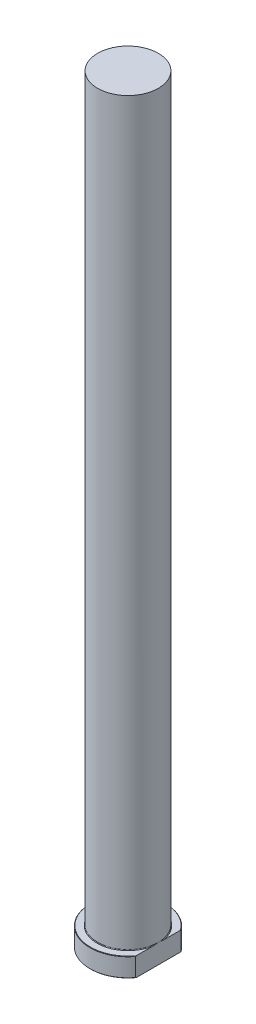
ISO-10303-21;
HEADER;
FILE_DESCRIPTION(('STEP AP214'),'2;1');
FILE_NAME('part.step','',(''),(''),'','','');
FILE_SCHEMA(('AUTOMOTIVE_DESIGN { 1 0 10303 214 1 1 1 1 }'));
ENDSEC;
DATA;
#1=APPLICATION_CONTEXT('core data for automotive mechanical design processes');
#2=APPLICATION_PROTOCOL_DEFINITION('international standard','automotive_design',2000,#1);
#3=PRODUCT_CONTEXT('',#1,'mechanical');
#4=PRODUCT('Part','Part','',(#3));
#5=PRODUCT_RELATED_PRODUCT_CATEGORY('part','',(#4));
#6=PRODUCT_DEFINITION_FORMATION('','',#4);
#7=PRODUCT_DEFINITION_CONTEXT('part definition',#1,'design');
#8=PRODUCT_DEFINITION('design','',#6,#7);
#9=PRODUCT_DEFINITION_SHAPE('','',#8);
#10=(LENGTH_UNIT() NAMED_UNIT(*) SI_UNIT(.MILLI.,.METRE.));
#11=(NAMED_UNIT(*) PLANE_ANGLE_UNIT() SI_UNIT($,.RADIAN.));
#12=(NAMED_UNIT(*) SI_UNIT($,.STERADIAN.) SOLID_ANGLE_UNIT());
#13=UNCERTAINTY_MEASURE_WITH_UNIT(LENGTH_MEASURE(1.E-05),#10,'distance_accuracy_value','');
#14=(GEOMETRIC_REPRESENTATION_CONTEXT(3) GLOBAL_UNCERTAINTY_ASSIGNED_CONTEXT((#13)) GLOBAL_UNIT_ASSIGNED_CONTEXT((#10,
#11,#12)) REPRESENTATION_CONTEXT('',''));
#15=CARTESIAN_POINT('',(0.,0.,0.));
#16=DIRECTION('',(0.,0.,1.));
#17=DIRECTION('',(1.,0.,0.));
#18=AXIS2_PLACEMENT_3D('',#15,#16,#17);
#19=CARTESIAN_POINT('',(0.,0.,0.));
#20=DIRECTION('',(0.,-1.,0.));
#21=DIRECTION('',(0.,0.,-1.));
#22=AXIS2_PLACEMENT_3D('',#19,#20,#21);
#23=PLANE('',#22);
#24=CARTESIAN_POINT('',(0.,0.,0.));
#25=DIRECTION('',(0.,-1.,0.));
#26=DIRECTION('',(0.,0.,-1.));
#27=AXIS2_PLACEMENT_3D('',#24,#25,#26);
#28=CIRCLE('',#27,19.8);
#29=CARTESIAN_POINT('',(16.,0.,11.6636186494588));
#30=VERTEX_POINT('',#29);
#31=CARTESIAN_POINT('',(16.,0.,-11.6636186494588));
#32=VERTEX_POINT('',#31);
#33=EDGE_CURVE('E98',#30,#32,#28,.T.);
#34=ORIENTED_EDGE('',*,*,#33,.T.);
#35=DIRECTION('',(0.,0.,1.));
#36=VECTOR('',#35,1.);
#37=CARTESIAN_POINT('',(16.,0.,-12.));
#38=LINE('',#37,#36);
#39=EDGE_CURVE('E83',#32,#30,#38,.T.);
#40=ORIENTED_EDGE('',*,*,#39,.T.);
#41=EDGE_LOOP('',(#34,#40));
#42=FACE_BOUND('',#41,.T.);
#43=ADVANCED_FACE('F32',(#42),#23,.T.);
#44=CARTESIAN_POINT('',(0.,259.958771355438,0.));
#45=DIRECTION('',(0.,1.,0.));
#46=DIRECTION('',(0.,0.,1.));
#47=AXIS2_PLACEMENT_3D('',#44,#45,#46);
#48=CYLINDRICAL_SURFACE('',#47,20.);
#49=CARTESIAN_POINT('',(0.,9.80000000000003,0.));
#50=DIRECTION('',(0.,1.,0.));
#51=DIRECTION('',(0.,0.,1.));
#52=AXIS2_PLACEMENT_3D('',#49,#50,#51);
#53=CIRCLE('',#52,20.);
#54=CARTESIAN_POINT('',(16.,9.80000000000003,12.));
#55=VERTEX_POINT('',#54);
#56=CARTESIAN_POINT('',(16.,9.80000000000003,-12.));
#57=VERTEX_POINT('',#56);
#58=EDGE_CURVE('E104',#55,#57,#53,.F.);
#59=ORIENTED_EDGE('',*,*,#58,.T.);
#60=DIRECTION('',(0.,-1.,0.));
#61=VECTOR('',#60,1.);
#62=CARTESIAN_POINT('',(16.,400.,-12.));
#63=LINE('',#62,#61);
#64=CARTESIAN_POINT('',(16.,0.199999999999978,-12.));
#65=VERTEX_POINT('',#64);
#66=EDGE_CURVE('E183',#57,#65,#63,.T.);
#67=ORIENTED_EDGE('',*,*,#66,.T.);
#68=CARTESIAN_POINT('',(0.,0.199999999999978,0.));
#69=DIRECTION('',(0.,-1.,0.));
#70=DIRECTION('',(0.,0.,-1.));
#71=AXIS2_PLACEMENT_3D('',#68,#69,#70);
#72=CIRCLE('',#71,20.);
#73=CARTESIAN_POINT('',(16.,0.199999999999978,12.));
#74=VERTEX_POINT('',#73);
#75=EDGE_CURVE('E100',#65,#74,#72,.F.);
#76=ORIENTED_EDGE('',*,*,#75,.T.);
#77=DIRECTION('',(0.,-1.,0.));
#78=VECTOR('',#77,1.);
#79=CARTESIAN_POINT('',(16.,400.,12.));
#80=LINE('',#79,#78);
#81=EDGE_CURVE('E93',#55,#74,#80,.T.);
#82=ORIENTED_EDGE('',*,*,#81,.F.);
#83=EDGE_LOOP('',(#59,#67,#76,#82));
#84=FACE_BOUND('',#83,.T.);
#85=ADVANCED_FACE('F158',(#84),#48,.T.);
#86=CARTESIAN_POINT('',(-20.,10.,0.));
#87=DIRECTION('',(0.,1.,0.));
#88=DIRECTION('',(0.,0.,1.));
#89=AXIS2_PLACEMENT_3D('',#86,#87,#88);
#90=PLANE('',#89);
#91=CARTESIAN_POINT('',(0.,10.,0.));
#92=DIRECTION('',(0.,1.,0.));
#93=DIRECTION('',(0.,0.,1.));
#94=AXIS2_PLACEMENT_3D('',#91,#92,#93);
#95=CIRCLE('',#94,19.8000000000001);
#96=CARTESIAN_POINT('',(16.,10.,-11.6636186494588));
#97=VERTEX_POINT('',#96);
#98=CARTESIAN_POINT('',(16.,10.,11.6636186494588));
#99=VERTEX_POINT('',#98);
#100=EDGE_CURVE('E178',#97,#99,#95,.T.);
#101=ORIENTED_EDGE('',*,*,#100,.T.);
#102=DIRECTION('',(0.,0.,-1.));
#103=VECTOR('',#102,1.);
#104=CARTESIAN_POINT('',(16.,10.,0.));
#105=LINE('',#104,#103);
#106=CARTESIAN_POINT('',(16.,10.,3.1128764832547));
#107=VERTEX_POINT('',#106);
#108=EDGE_CURVE('E57',#99,#107,#105,.T.);
#109=ORIENTED_EDGE('',*,*,#108,.T.);
#110=CARTESIAN_POINT('',(0.,10.,0.));
#111=DIRECTION('',(0.,1.,0.));
#112=DIRECTION('',(0.,0.,1.));
#113=AXIS2_PLACEMENT_3D('',#110,#111,#112);
#114=CIRCLE('',#113,16.3);
#115=CARTESIAN_POINT('',(16.,10.,-3.11287648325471));
#116=VERTEX_POINT('',#115);
#117=EDGE_CURVE('E107',#107,#116,#114,.F.);
#118=ORIENTED_EDGE('',*,*,#117,.T.);
#119=EDGE_CURVE('E136',#116,#97,#105,.T.);
#120=ORIENTED_EDGE('',*,*,#119,.T.);
#121=EDGE_LOOP('',(#101,#109,#118,#120));
#122=FACE_BOUND('',#121,.T.);
#123=ADVANCED_FACE('F147',(#122),#90,.T.);
#124=CARTESIAN_POINT('',(0.,10.,0.));
#125=DIRECTION('',(0.,-1.,0.));
#126=DIRECTION('',(0.,0.,-1.));
#127=AXIS2_PLACEMENT_3D('',#124,#125,#126);
#128=CONICAL_SURFACE('',#127,19.8,0.785398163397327);
#129=ORIENTED_EDGE('',*,*,#58,.F.);
#130=CARTESIAN_POINT('',(16.,-1.07064884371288,26.4006999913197));
#131=CARTESIAN_POINT('',(16.,-0.733156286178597,26.0060486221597));
#132=CARTESIAN_POINT('',(16.,-0.396819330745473,25.6104050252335));
#133=CARTESIAN_POINT('',(16.,0.27320617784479,24.8168690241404));
#134=CARTESIAN_POINT('',(16.,0.606894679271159,24.4189765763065));
#135=CARTESIAN_POINT('',(16.,1.27144329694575,23.6204891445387));
#136=CARTESIAN_POINT('',(16.,1.60230187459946,23.2198928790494));
#137=CARTESIAN_POINT('',(16.,2.26059114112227,22.4158945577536));
#138=CARTESIAN_POINT('',(16.,2.58802184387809,22.0124925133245));
#139=CARTESIAN_POINT('',(16.,3.24766747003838,21.1916872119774));
#140=CARTESIAN_POINT('',(16.,3.57977582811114,20.7741982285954));
#141=CARTESIAN_POINT('',(16.,4.23919239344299,19.935447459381));
#142=CARTESIAN_POINT('',(16.,4.56650063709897,19.5141857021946));
#143=CARTESIAN_POINT('',(16.,5.21544461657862,18.6674666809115));
#144=CARTESIAN_POINT('',(16.,5.53708166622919,18.242010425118));
#145=CARTESIAN_POINT('',(16.,6.17378218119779,17.3861997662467));
#146=CARTESIAN_POINT('',(16.,6.48884565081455,16.9558453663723));
#147=CARTESIAN_POINT('',(16.,7.11176935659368,16.0887218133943));
#148=CARTESIAN_POINT('',(16.,7.41961501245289,15.6519421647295));
#149=CARTESIAN_POINT('',(16.,8.02597466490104,14.7719292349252));
#150=CARTESIAN_POINT('',(16.,8.32448855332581,14.3286958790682));
#151=CARTESIAN_POINT('',(16.,8.91052998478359,13.4344389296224));
#152=CARTESIAN_POINT('',(16.,9.19804754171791,12.9834087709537));
#153=CARTESIAN_POINT('',(16.,9.75938980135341,12.0728858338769));
#154=CARTESIAN_POINT('',(16.,10.0332147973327,11.6133932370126));
#155=CARTESIAN_POINT('',(16.,10.5615335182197,10.6892898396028));
#156=CARTESIAN_POINT('',(16.,10.8161891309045,10.2247720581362));
#157=CARTESIAN_POINT('',(16.,11.3053445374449,9.28510847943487));
#158=CARTESIAN_POINT('',(16.,11.5398419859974,8.80996145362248));
#159=CARTESIAN_POINT('',(16.,11.9836278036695,7.84885100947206));
#160=CARTESIAN_POINT('',(16.,12.1929556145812,7.36290596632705));
#161=CARTESIAN_POINT('',(16.,12.5811435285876,6.37912337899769));
#162=CARTESIAN_POINT('',(16.,12.7600157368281,5.88129064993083));
#163=CARTESIAN_POINT('',(16.,13.0861366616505,4.85753764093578));
#164=CARTESIAN_POINT('',(16.,13.23219103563,4.33122827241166));
#165=CARTESIAN_POINT('',(16.,13.4164504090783,3.53379728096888));
#166=CARTESIAN_POINT('',(16.,13.4720698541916,3.26663533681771));
#167=CARTESIAN_POINT('',(16.,13.5709016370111,2.73003918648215));
#168=CARTESIAN_POINT('',(16.,13.614115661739,2.46060529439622));
#169=CARTESIAN_POINT('',(16.,13.6872774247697,1.9211763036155));
#170=CARTESIAN_POINT('',(16.,13.7172841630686,1.65118922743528));
#171=CARTESIAN_POINT('',(16.,13.7638048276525,1.11005042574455));
#172=CARTESIAN_POINT('',(16.,13.7803188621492,0.838898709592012));
#173=CARTESIAN_POINT('',(16.,13.7995586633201,0.296109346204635));
#174=CARTESIAN_POINT('',(16.,13.80228470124,0.0244717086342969));
#175=CARTESIAN_POINT('',(16.,13.7939006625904,-0.518588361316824));
#176=CARTESIAN_POINT('',(16.,13.7827905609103,-0.790010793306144));
#177=CARTESIAN_POINT('',(16.,13.7469663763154,-1.33142514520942));
#178=CARTESIAN_POINT('',(16.,13.7222788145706,-1.60141882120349));
#179=CARTESIAN_POINT('',(16.,13.6597540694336,-2.13989179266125));
#180=CARTESIAN_POINT('',(16.,13.6219151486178,-2.4083708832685));
#181=CARTESIAN_POINT('',(16.,13.4895557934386,-3.21066813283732));
#182=CARTESIAN_POINT('',(16.,13.3761851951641,-3.74145456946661));
#183=CARTESIAN_POINT('',(16.,13.1048507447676,-4.79469191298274));
#184=CARTESIAN_POINT('',(16.,12.946620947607,-5.31707285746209));
#185=CARTESIAN_POINT('',(16.,12.6815624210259,-6.09095035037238));
#186=CARTESIAN_POINT('',(16.,12.5885858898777,-6.34730496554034));
#187=CARTESIAN_POINT('',(16.,12.3942381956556,-6.85681818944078));
#188=CARTESIAN_POINT('',(16.,12.2928668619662,-7.10997673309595));
#189=CARTESIAN_POINT('',(16.,11.9087737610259,-8.02895093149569));
#190=CARTESIAN_POINT('',(16.,11.6032209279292,-8.68528507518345));
#191=CARTESIAN_POINT('',(16.,10.9520387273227,-9.97785473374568));
#192=CARTESIAN_POINT('',(16.,10.6063845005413,-10.6140774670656));
#193=CARTESIAN_POINT('',(16.,9.88410853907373,-11.8704402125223));
#194=CARTESIAN_POINT('',(16.,9.50742027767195,-12.4905417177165));
#195=CARTESIAN_POINT('',(16.,8.73104614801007,-13.7158784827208));
#196=CARTESIAN_POINT('',(16.,8.33136526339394,-14.3211169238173));
#197=CARTESIAN_POINT('',(16.,7.51225576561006,-15.5221520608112));
#198=CARTESIAN_POINT('',(16.,7.09274396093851,-16.1178917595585));
#199=CARTESIAN_POINT('',(16.,6.23957009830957,-17.2991512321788));
#200=CARTESIAN_POINT('',(16.,5.80590743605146,-17.8846705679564));
#201=CARTESIAN_POINT('',(16.,4.9278350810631,-19.0464967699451));
#202=CARTESIAN_POINT('',(16.,4.48343853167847,-19.6228135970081));
#203=CARTESIAN_POINT('',(16.,3.58557777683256,-20.7683027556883));
#204=CARTESIAN_POINT('',(16.,3.13211380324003,-21.337475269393));
#205=CARTESIAN_POINT('',(16.,2.3674402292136,-22.2844266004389));
#206=CARTESIAN_POINT('',(16.,2.05826684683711,-22.6638539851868));
#207=CARTESIAN_POINT('',(16.,1.43690833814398,-23.420322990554));
#208=CARTESIAN_POINT('',(16.,1.12472279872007,-23.7973642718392));
#209=CARTESIAN_POINT('',(16.,0.49995656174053,-24.5465888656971));
#210=CARTESIAN_POINT('',(16.,0.18739441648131,-24.9187876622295));
#211=CARTESIAN_POINT('',(16.,-0.439990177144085,-25.6611808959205));
#212=CARTESIAN_POINT('',(16.,-0.754812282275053,-26.0313756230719));
#213=CARTESIAN_POINT('',(16.,-1.07064884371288,-26.4006999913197));
#214=B_SPLINE_CURVE_WITH_KNOTS('',3,(#130,#131,#132,#133,#134,#135,#136,#137,#138,#139,#140,
#141,#142,#143,#144,#145,#146,#147,#148,#149,#150,#151,#152,#153,#154,#155,#156,#157,#158,#159,
#160,#161,#162,#163,#164,#165,#166,#167,#168,#169,#170,#171,#172,#173,#174,#175,#176,#177,#178,
#179,#180,#181,#182,#183,#184,#185,#186,#187,#188,#189,#190,#191,#192,#193,#194,#195,#196,#197,
#198,#199,#200,#201,#202,#203,#204,#205,#206,#207,#208,#209,#210,#211,#212,#213),.UNSPECIFIED.,
.F.,.F.,(4,2,2,2,2,2,2,2,2,2,2,2,2,2,2,2,2,2,2,2,2,2,2,2,2,2,2,2,2,2,2,2,2,2,2,2,2,2,2,2,2,4),
(0.,1.55783999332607,3.11571034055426,4.67437978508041,6.23304291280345,7.83343038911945,
9.43380572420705,11.0338053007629,12.6338038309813,14.2367959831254,15.8398067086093,
17.4442401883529,19.0486392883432,20.6374598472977,22.2264650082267,23.8129467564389,
25.3987964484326,27.0353648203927,27.8537926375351,28.6721091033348,29.4867319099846,
30.3013481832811,31.1159484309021,31.9305501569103,32.7435663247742,33.5566899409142,
35.1826128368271,36.8183840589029,37.6363419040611,38.4543163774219,40.6241539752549,
42.795343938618,44.9713157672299,47.1468177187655,49.3324366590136,51.5181490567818,
53.7013086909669,55.8844125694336,57.3527237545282,58.821239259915,60.2793254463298,
61.7371946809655),.UNSPECIFIED.);
#215=EDGE_CURVE('E135',#55,#99,#214,.T.);
#216=ORIENTED_EDGE('',*,*,#215,.T.);
#217=ORIENTED_EDGE('',*,*,#100,.F.);
#218=EDGE_CURVE('E127',#97,#57,#214,.T.);
#219=ORIENTED_EDGE('',*,*,#218,.T.);
#220=EDGE_LOOP('',(#129,#216,#217,#219));
#221=FACE_BOUND('',#220,.T.);
#222=ADVANCED_FACE('F143',(#221),#128,.T.);
#223=CARTESIAN_POINT('',(0.,0.199999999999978,0.));
#224=DIRECTION('',(0.,1.,0.));
#225=DIRECTION('',(0.,0.,1.));
#226=AXIS2_PLACEMENT_3D('',#223,#224,#225);
#227=CONICAL_SURFACE('',#226,20.,0.785398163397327);
#228=ORIENTED_EDGE('',*,*,#75,.F.);
#229=CARTESIAN_POINT('',(16.,11.0706488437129,-26.4006999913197));
#230=CARTESIAN_POINT('',(16.,10.7331562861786,-26.0060486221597));
#231=CARTESIAN_POINT('',(16.,10.3968193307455,-25.6104050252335));
#232=CARTESIAN_POINT('',(16.,9.72679382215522,-24.8168690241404));
#233=CARTESIAN_POINT('',(16.,9.39310532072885,-24.4189765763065));
#234=CARTESIAN_POINT('',(16.,8.72855670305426,-23.6204891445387));
#235=CARTESIAN_POINT('',(16.,8.39769812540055,-23.2198928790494));
#236=CARTESIAN_POINT('',(16.,7.73940885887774,-22.4158945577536));
#237=CARTESIAN_POINT('',(16.,7.41197815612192,-22.0124925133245));
#238=CARTESIAN_POINT('',(16.,6.75233252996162,-21.1916872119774));
#239=CARTESIAN_POINT('',(16.,6.42022417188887,-20.7741982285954));
#240=CARTESIAN_POINT('',(16.,5.76080760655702,-19.935447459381));
#241=CARTESIAN_POINT('',(16.,5.43349936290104,-19.5141857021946));
#242=CARTESIAN_POINT('',(16.,4.78455538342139,-18.6674666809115));
#243=CARTESIAN_POINT('',(16.,4.46291833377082,-18.242010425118));
#244=CARTESIAN_POINT('',(16.,3.82621781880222,-17.3861997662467));
#245=CARTESIAN_POINT('',(16.,3.51115434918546,-16.9558453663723));
#246=CARTESIAN_POINT('',(16.,2.88823064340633,-16.0887218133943));
#247=CARTESIAN_POINT('',(16.,2.58038498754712,-15.6519421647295));
#248=CARTESIAN_POINT('',(16.,1.97402533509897,-14.7719292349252));
#249=CARTESIAN_POINT('',(16.,1.6755114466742,-14.3286958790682));
#250=CARTESIAN_POINT('',(16.,1.08947001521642,-13.4344389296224));
#251=CARTESIAN_POINT('',(16.,0.801952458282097,-12.9834087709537));
#252=CARTESIAN_POINT('',(16.,0.240610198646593,-12.0728858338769));
#253=CARTESIAN_POINT('',(16.,-0.0332147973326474,-11.6133932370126));
#254=CARTESIAN_POINT('',(16.,-0.561533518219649,-10.6892898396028));
#255=CARTESIAN_POINT('',(16.,-0.816189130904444,-10.2247720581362));
#256=CARTESIAN_POINT('',(16.,-1.30534453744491,-9.28510847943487));
#257=CARTESIAN_POINT('',(16.,-1.53984198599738,-8.80996145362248));
#258=CARTESIAN_POINT('',(16.,-1.98362780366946,-7.84885100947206));
#259=CARTESIAN_POINT('',(16.,-2.19295561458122,-7.36290596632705));
#260=CARTESIAN_POINT('',(16.,-2.58114352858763,-6.3791233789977));
#261=CARTESIAN_POINT('',(16.,-2.76001573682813,-5.88129064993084));
#262=CARTESIAN_POINT('',(16.,-3.08613666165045,-4.85753764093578));
#263=CARTESIAN_POINT('',(16.,-3.23219103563,-4.33122827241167));
#264=CARTESIAN_POINT('',(16.,-3.41645040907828,-3.53379728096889));
#265=CARTESIAN_POINT('',(16.,-3.47206985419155,-3.26663533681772));
#266=CARTESIAN_POINT('',(16.,-3.57090163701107,-2.73003918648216));
#267=CARTESIAN_POINT('',(16.,-3.61411566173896,-2.46060529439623));
#268=CARTESIAN_POINT('',(16.,-3.68727742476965,-1.9211763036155));
#269=CARTESIAN_POINT('',(16.,-3.71728416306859,-1.65118922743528));
#270=CARTESIAN_POINT('',(16.,-3.7638048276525,-1.11005042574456));
#271=CARTESIAN_POINT('',(16.,-3.78031886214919,-0.838898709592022));
#272=CARTESIAN_POINT('',(16.,-3.79955866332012,-0.296109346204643));
#273=CARTESIAN_POINT('',(16.,-3.80228470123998,-0.0244717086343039));
#274=CARTESIAN_POINT('',(16.,-3.79390066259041,0.518588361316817));
#275=CARTESIAN_POINT('',(16.,-3.78279056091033,0.790010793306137));
#276=CARTESIAN_POINT('',(16.,-3.74696637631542,1.33142514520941));
#277=CARTESIAN_POINT('',(16.,-3.72227881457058,1.60141882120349));
#278=CARTESIAN_POINT('',(16.,-3.65975406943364,2.13989179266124));
#279=CARTESIAN_POINT('',(16.,-3.62191514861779,2.40837088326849));
#280=CARTESIAN_POINT('',(16.,-3.48955579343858,3.21066813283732));
#281=CARTESIAN_POINT('',(16.,-3.37618519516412,3.7414545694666));
#282=CARTESIAN_POINT('',(16.,-3.10485074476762,4.79469191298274));
#283=CARTESIAN_POINT('',(16.,-2.94662094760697,5.31707285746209));
#284=CARTESIAN_POINT('',(16.,-2.68156242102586,6.09095035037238));
#285=CARTESIAN_POINT('',(16.,-2.58858588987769,6.34730496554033));
#286=CARTESIAN_POINT('',(16.,-2.39423819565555,6.85681818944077));
#287=CARTESIAN_POINT('',(16.,-2.29286686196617,7.10997673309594));
#288=CARTESIAN_POINT('',(16.,-1.90877376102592,8.02895093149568));
#289=CARTESIAN_POINT('',(16.,-1.60322092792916,8.68528507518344));
#290=CARTESIAN_POINT('',(16.,-0.952038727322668,9.97785473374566));
#291=CARTESIAN_POINT('',(16.,-0.606384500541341,10.6140774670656));
#292=CARTESIAN_POINT('',(16.,0.115891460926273,11.8704402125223));
#293=CARTESIAN_POINT('',(16.,0.492579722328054,12.4905417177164));
#294=CARTESIAN_POINT('',(16.,1.26895385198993,13.7158784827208));
#295=CARTESIAN_POINT('',(16.,1.66863473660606,14.3211169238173));
#296=CARTESIAN_POINT('',(16.,2.48774423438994,15.5221520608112));
#297=CARTESIAN_POINT('',(16.,2.90725603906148,16.1178917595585));
#298=CARTESIAN_POINT('',(16.,3.76042990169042,17.2991512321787));
#299=CARTESIAN_POINT('',(16.,4.19409256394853,17.8846705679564));
#300=CARTESIAN_POINT('',(16.,5.07216491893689,19.0464967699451));
#301=CARTESIAN_POINT('',(16.,5.51656146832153,19.622813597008));
#302=CARTESIAN_POINT('',(16.,6.41442222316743,20.7683027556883));
#303=CARTESIAN_POINT('',(16.,6.86788619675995,21.337475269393));
#304=CARTESIAN_POINT('',(16.,7.63255977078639,22.2844266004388));
#305=CARTESIAN_POINT('',(16.,7.94173315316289,22.6638539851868));
#306=CARTESIAN_POINT('',(16.,8.56309166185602,23.4203229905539));
#307=CARTESIAN_POINT('',(16.,8.87527720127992,23.7973642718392));
#308=CARTESIAN_POINT('',(16.,9.50004343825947,24.5465888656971));
#309=CARTESIAN_POINT('',(16.,9.81260558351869,24.9187876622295));
#310=CARTESIAN_POINT('',(16.,10.4399901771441,25.6611808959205));
#311=CARTESIAN_POINT('',(16.,10.7548122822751,26.0313756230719));
#312=CARTESIAN_POINT('',(16.,11.0706488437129,26.4006999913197));
#313=B_SPLINE_CURVE_WITH_KNOTS('',3,(#229,#230,#231,#232,#233,#234,#235,#236,#237,#238,#239,
#240,#241,#242,#243,#244,#245,#246,#247,#248,#249,#250,#251,#252,#253,#254,#255,#256,#257,#258,
#259,#260,#261,#262,#263,#264,#265,#266,#267,#268,#269,#270,#271,#272,#273,#274,#275,#276,#277,
#278,#279,#280,#281,#282,#283,#284,#285,#286,#287,#288,#289,#290,#291,#292,#293,#294,#295,#296,
#297,#298,#299,#300,#301,#302,#303,#304,#305,#306,#307,#308,#309,#310,#311,#312),.UNSPECIFIED.,
.F.,.F.,(4,2,2,2,2,2,2,2,2,2,2,2,2,2,2,2,2,2,2,2,2,2,2,2,2,2,2,2,2,2,2,2,2,2,2,2,2,2,2,2,2,4),
(0.,1.55783999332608,3.11571034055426,4.67437978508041,6.23304291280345,7.83343038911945,
9.43380572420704,11.0338053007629,12.6338038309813,14.2367959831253,15.8398067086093,
17.4442401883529,19.0486392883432,20.6374598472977,22.2264650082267,23.8129467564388,
25.3987964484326,27.0353648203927,27.8537926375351,28.6721091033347,29.4867319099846,
30.3013481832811,31.1159484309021,31.9305501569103,32.7435663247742,33.5566899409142,
35.1826128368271,36.8183840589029,37.6363419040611,38.4543163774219,40.6241539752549,
42.795343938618,44.9713157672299,47.1468177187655,49.3324366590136,51.5181490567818,
53.7013086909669,55.8844125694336,57.3527237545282,58.821239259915,60.2793254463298,
61.7371946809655),.UNSPECIFIED.);
#314=EDGE_CURVE('E86',#65,#32,#313,.T.);
#315=ORIENTED_EDGE('',*,*,#314,.T.);
#316=ORIENTED_EDGE('',*,*,#33,.F.);
#317=EDGE_CURVE('E89',#30,#74,#313,.T.);
#318=ORIENTED_EDGE('',*,*,#317,.T.);
#319=EDGE_LOOP('',(#228,#315,#316,#318));
#320=FACE_BOUND('',#319,.T.);
#321=ADVANCED_FACE('F97',(#320),#227,.T.);
#322=CARTESIAN_POINT('',(0.,10.3,0.));
#323=DIRECTION('',(0.,1.,0.));
#324=DIRECTION('',(0.,0.,1.));
#325=AXIS2_PLACEMENT_3D('',#322,#323,#324);
#326=TOROIDAL_SURFACE('',#325,16.3,0.3);
#327=CARTESIAN_POINT('',(16.,10.3,0.));
#328=CARTESIAN_POINT('',(16.,10.3000006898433,-5.33715911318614E-09));
#329=CARTESIAN_POINT('',(16.,10.3000013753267,-5.90477996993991E-07));
#330=CARTESIAN_POINT('',(16.,10.3000026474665,-1.99315110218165E-06));
#331=CARTESIAN_POINT('',(16.,10.3000031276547,-2.82387138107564E-06));
#332=CARTESIAN_POINT('',(16.,10.300004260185,-4.93201352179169E-06));
#333=CARTESIAN_POINT('',(16.,10.300004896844,-6.24688723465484E-06));
#334=CARTESIAN_POINT('',(16.,10.3000059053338,-8.79561581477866E-06));
#335=CARTESIAN_POINT('',(16.,10.3000062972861,-1.00244169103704E-05));
#336=CARTESIAN_POINT('',(16.,10.3000079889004,-1.53269558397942E-05));
#337=CARTESIAN_POINT('',(16.,10.3000092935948,-1.94146126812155E-05));
#338=CARTESIAN_POINT('',(16.,10.3000111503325,-2.70530674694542E-05));
#339=CARTESIAN_POINT('',(16.,10.300011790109,-3.05834546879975E-05));
#340=CARTESIAN_POINT('',(16.,10.3000164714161,-5.69924666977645E-05));
#341=CARTESIAN_POINT('',(16.,10.3000199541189,-7.99464318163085E-05));
#342=CARTESIAN_POINT('',(16.,10.3000322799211,-0.000171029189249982));
#343=CARTESIAN_POINT('',(16.,10.3000382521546,-0.000239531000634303));
#344=CARTESIAN_POINT('',(16.,10.3000656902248,-0.00050618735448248));
#345=CARTESIAN_POINT('',(16.,10.3000950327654,-0.0007033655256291));
#346=CARTESIAN_POINT('',(16.,10.3002038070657,-0.0014556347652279));
#347=CARTESIAN_POINT('',(16.,10.300277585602,-0.00201139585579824));
#348=CARTESIAN_POINT('',(16.,10.3005644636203,-0.00414914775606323));
#349=CARTESIAN_POINT('',(16.,10.300783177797,-0.00573048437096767));
#350=CARTESIAN_POINT('',(16.,10.3018172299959,-0.0132287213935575));
#351=CARTESIAN_POINT('',(16.,10.3026243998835,-0.0191465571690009));
#352=CARTESIAN_POINT('',(16.,10.3110865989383,-0.0811528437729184));
#353=CARTESIAN_POINT('',(16.,10.3187815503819,-0.137236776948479));
#354=CARTESIAN_POINT('',(16.,10.3348868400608,-0.255096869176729));
#355=CARTESIAN_POINT('',(16.,10.343290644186,-0.316873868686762));
#356=CARTESIAN_POINT('',(16.,10.3571569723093,-0.419331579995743));
#357=CARTESIAN_POINT('',(16.,10.3626434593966,-0.460008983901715));
#358=CARTESIAN_POINT('',(16.,10.3734224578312,-0.540334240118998));
#359=CARTESIAN_POINT('',(16.,10.3787163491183,-0.579981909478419));
#360=CARTESIAN_POINT('',(16.,10.4083966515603,-0.803619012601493));
#361=CARTESIAN_POINT('',(16.,10.4321379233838,-0.987696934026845));
#362=CARTESIAN_POINT('',(16.,10.4771585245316,-1.35808125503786));
#363=CARTESIAN_POINT('',(16.,10.4984099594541,-1.54439106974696));
#364=CARTESIAN_POINT('',(16.,10.5392977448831,-1.94430528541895));
#365=CARTESIAN_POINT('',(16.,10.5582626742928,-2.15798298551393));
#366=CARTESIAN_POINT('',(16.,10.5798230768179,-2.47853128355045));
#367=CARTESIAN_POINT('',(16.,10.5858566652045,-2.58516682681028));
#368=CARTESIAN_POINT('',(16.,10.5950189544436,-2.79855398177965));
#369=CARTESIAN_POINT('',(16.,10.5981480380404,-2.90530557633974));
#370=CARTESIAN_POINT('',(16.,10.6006064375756,-3.11480969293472));
#371=CARTESIAN_POINT('',(16.,10.600075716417,-3.21755992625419));
#372=CARTESIAN_POINT('',(16.,10.5957602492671,-3.37181907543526));
#373=CARTESIAN_POINT('',(16.,10.593726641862,-3.42337702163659));
#374=CARTESIAN_POINT('',(16.,10.5882429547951,-3.52640582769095));
#375=CARTESIAN_POINT('',(16.,10.584793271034,-3.57787670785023));
#376=CARTESIAN_POINT('',(16.,10.5763123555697,-3.67890194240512));
#377=CARTESIAN_POINT('',(16.,10.5713398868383,-3.72846106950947));
#378=CARTESIAN_POINT('',(16.,10.5593485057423,-3.82738811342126));
#379=CARTESIAN_POINT('',(16.,10.5523274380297,-3.87675577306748));
#380=CARTESIAN_POINT('',(16.,10.5356271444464,-3.97473922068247));
#381=CARTESIAN_POINT('',(16.,10.5259654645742,-4.02335780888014));
#382=CARTESIAN_POINT('',(16.,10.5085240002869,-4.09553189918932));
#383=CARTESIAN_POINT('',(16.,10.5022253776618,-4.11944402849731));
#384=CARTESIAN_POINT('',(16.,10.4883597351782,-4.16689390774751));
#385=CARTESIAN_POINT('',(16.,10.4807934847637,-4.19043187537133));
#386=CARTESIAN_POINT('',(16.,10.468072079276,-4.22548932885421));
#387=CARTESIAN_POINT('',(16.,10.463554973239,-4.23724015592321));
#388=CARTESIAN_POINT('',(16.,10.4539723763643,-4.2605292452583));
#389=CARTESIAN_POINT('',(16.,10.4489064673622,-4.27206733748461));
#390=CARTESIAN_POINT('',(16.,10.4380905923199,-4.29485009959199));
#391=CARTESIAN_POINT('',(16.,10.4323392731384,-4.30609413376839));
#392=CARTESIAN_POINT('',(16.,10.4199753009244,-4.32809262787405));
#393=CARTESIAN_POINT('',(16.,10.4133636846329,-4.33884765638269));
#394=CARTESIAN_POINT('',(16.,10.3989169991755,-4.35969720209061));
#395=CARTESIAN_POINT('',(16.,10.3910687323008,-4.36978269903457));
#396=CARTESIAN_POINT('',(16.,10.3737930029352,-4.38847604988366));
#397=CARTESIAN_POINT('',(16.,10.3643793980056,-4.39709563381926));
#398=CARTESIAN_POINT('',(16.,10.349684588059,-4.40721260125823));
#399=CARTESIAN_POINT('',(16.,10.3452411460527,-4.40991204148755));
#400=CARTESIAN_POINT('',(16.,10.3360120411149,-4.41465735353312));
#401=CARTESIAN_POINT('',(16.,10.331226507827,-4.41670347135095));
#402=CARTESIAN_POINT('',(16.,10.321316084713,-4.41997867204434));
#403=CARTESIAN_POINT('',(16.,10.3161880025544,-4.42119837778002));
#404=CARTESIAN_POINT('',(16.,10.3057936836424,-4.42262740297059));
#405=CARTESIAN_POINT('',(16.,10.3005276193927,-4.42283792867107));
#406=CARTESIAN_POINT('',(16.,10.2906214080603,-4.42225569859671));
#407=CARTESIAN_POINT('',(16.,10.285974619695,-4.42156796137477));
#408=CARTESIAN_POINT('',(16.,10.2768560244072,-4.41944337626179));
#409=CARTESIAN_POINT('',(16.,10.2723843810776,-4.41800584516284));
#410=CARTESIAN_POINT('',(16.,10.2619701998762,-4.41381248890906));
#411=CARTESIAN_POINT('',(16.,10.2561483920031,-4.4107598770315));
#412=CARTESIAN_POINT('',(16.,10.2450526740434,-4.40378684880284));
#413=CARTESIAN_POINT('',(16.,10.239780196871,-4.39986424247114));
#414=CARTESIAN_POINT('',(16.,10.2257729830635,-4.38808908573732));
#415=CARTESIAN_POINT('',(16.,10.2175965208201,-4.37958133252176));
#416=CARTESIAN_POINT('',(16.,10.2024790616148,-4.36154434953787));
#417=CARTESIAN_POINT('',(16.,10.1955419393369,-4.35201206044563));
#418=CARTESIAN_POINT('',(16.,10.1791886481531,-4.32717029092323));
#419=CARTESIAN_POINT('',(16.,10.1703884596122,-4.31145991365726));
#420=CARTESIAN_POINT('',(16.,10.154248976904,-4.2792945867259));
#421=CARTESIAN_POINT('',(16.,10.1469131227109,-4.26283799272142));
#422=CARTESIAN_POINT('',(16.,10.1332947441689,-4.22939871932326));
#423=CARTESIAN_POINT('',(16.,10.1270179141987,-4.2124137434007));
#424=CARTESIAN_POINT('',(16.,10.1153239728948,-4.17817736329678));
#425=CARTESIAN_POINT('',(16.,10.1099058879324,-4.16092628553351));
#426=CARTESIAN_POINT('',(16.,10.0949674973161,-4.10989946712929));
#427=CARTESIAN_POINT('',(16.,10.0863847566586,-4.07584989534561));
#428=CARTESIAN_POINT('',(16.,10.0710343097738,-4.00733871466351));
#429=CARTESIAN_POINT('',(16.,10.0642677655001,-3.97287685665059));
#430=CARTESIAN_POINT('',(16.,10.0460186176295,-3.86898411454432));
#431=CARTESIAN_POINT('',(16.,10.036623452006,-3.79918851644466));
#432=CARTESIAN_POINT('',(16.,10.0215249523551,-3.65915321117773));
#433=CARTESIAN_POINT('',(16.,10.0158261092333,-3.58891306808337));
#434=CARTESIAN_POINT('',(16.,10.0072116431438,-3.44836432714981));
#435=CARTESIAN_POINT('',(16.,10.00429218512,-3.37805595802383));
#436=CARTESIAN_POINT('',(16.,10.000668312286,-3.23904020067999));
#437=CARTESIAN_POINT('',(16.,9.99991350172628,-3.17033397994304));
#438=CARTESIAN_POINT('',(16.,10.0001018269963,-3.03292208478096));
#439=CARTESIAN_POINT('',(16.,10.0010450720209,-2.96421641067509));
#440=CARTESIAN_POINT('',(16.,10.0059904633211,-2.75810886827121));
#441=CARTESIAN_POINT('',(16.,10.0121089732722,-2.62075798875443));
#442=CARTESIAN_POINT('',(16.,10.0284391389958,-2.34612718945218));
#443=CARTESIAN_POINT('',(16.,10.0386564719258,-2.20884763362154));
#444=CARTESIAN_POINT('',(16.,10.0621466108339,-1.93454208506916));
#445=CARTESIAN_POINT('',(16.,10.075419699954,-1.79751611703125));
#446=CARTESIAN_POINT('',(16.,10.118522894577,-1.38740066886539));
#447=CARTESIAN_POINT('',(16.,10.1516806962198,-1.11466812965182));
#448=CARTESIAN_POINT('',(16.,10.2220528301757,-0.569702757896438));
#449=CARTESIAN_POINT('',(16.,10.259267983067,-0.297470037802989));
#450=CARTESIAN_POINT('',(16.,10.2965515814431,-0.0251841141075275));
#451=CARTESIAN_POINT('',(16.,10.2965597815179,-0.0251242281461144));
#452=CARTESIAN_POINT('',(16.,10.2972621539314,-0.019994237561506));
#453=CARTESIAN_POINT('',(16.,10.2979507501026,-0.0149234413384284));
#454=CARTESIAN_POINT('',(16.,10.2989595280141,-0.00761717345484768));
#455=CARTESIAN_POINT('',(16.,10.2992705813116,-0.00538056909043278));
#456=CARTESIAN_POINT('',(16.,10.2996656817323,-0.00242425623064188));
#457=CARTESIAN_POINT('',(16.,10.2997604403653,-0.00170587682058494));
#458=CARTESIAN_POINT('',(16.,10.2998960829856,-0.000765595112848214));
#459=CARTESIAN_POINT('',(16.,10.2999290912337,-0.000542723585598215));
#460=CARTESIAN_POINT('',(16.,10.2999593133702,-0.000246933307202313));
#461=CARTESIAN_POINT('',(16.,10.2999656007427,-0.000175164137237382));
#462=CARTESIAN_POINT('',(16.,10.2999790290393,-8.05668880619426E-05));
#463=CARTESIAN_POINT('',(16.,10.2999827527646,-5.72823548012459E-05));
#464=CARTESIAN_POINT('',(16.,10.2999877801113,-3.05492734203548E-05));
#465=CARTESIAN_POINT('',(16.,10.2999884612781,-2.70084595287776E-05));
#466=CARTESIAN_POINT('',(16.,10.2999904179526,-1.93523012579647E-05));
#467=CARTESIAN_POINT('',(16.,10.2999917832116,-1.52589672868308E-05));
#468=CARTESIAN_POINT('',(16.,10.2999935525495,-9.95362422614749E-06));
#469=CARTESIAN_POINT('',(16.,10.2999939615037,-8.72734435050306E-06));
#470=CARTESIAN_POINT('',(16.,10.2999950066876,-6.18658496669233E-06));
#471=CARTESIAN_POINT('',(16.,10.2999956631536,-4.87748836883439E-06));
#472=CARTESIAN_POINT('',(16.,10.2999968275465,-2.7813010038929E-06));
#473=CARTESIAN_POINT('',(16.,10.2999973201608,-1.95628425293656E-06));
#474=CARTESIAN_POINT('',(16.,10.2999986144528,-5.7037197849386E-07));
#475=CARTESIAN_POINT('',(16.,10.299999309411,5.3429283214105E-09));
#476=CARTESIAN_POINT('',(16.,10.3,0.));
#477=B_SPLINE_CURVE_WITH_KNOTS('',3,(#327,#328,#329,#330,#331,#332,#333,#334,#335,#336,#337,
#338,#339,#340,#341,#342,#343,#344,#345,#346,#347,#348,#349,#350,#351,#352,#353,#354,#355,#356,
#357,#358,#359,#360,#361,#362,#363,#364,#365,#366,#367,#368,#369,#370,#371,#372,#373,#374,#375,
#376,#377,#378,#379,#380,#381,#382,#383,#384,#385,#386,#387,#388,#389,#390,#391,#392,#393,#394,
#395,#396,#397,#398,#399,#400,#401,#402,#403,#404,#405,#406,#407,#408,#409,#410,#411,#412,#413,
#414,#415,#416,#417,#418,#419,#420,#421,#422,#423,#424,#425,#426,#427,#428,#429,#430,#431,#432,
#433,#434,#435,#436,#437,#438,#439,#440,#441,#442,#443,#444,#445,#446,#447,#448,#449,#450,#451,
#452,#453,#454,#455,#456,#457,#458,#459,#460,#461,#462,#463,#464,#465,#466,#467,#468,#469,#470,
#471,#472,#473,#474,#475,#476),.UNSPECIFIED.,.T.,.F.,(4,2,2,2,2,2,2,2,2,2,2,2,2,2,2,2,2,2,2,2,2,
2,2,2,2,2,2,2,2,2,2,2,2,2,2,2,2,2,2,2,2,2,2,2,2,2,2,2,2,2,2,2,2,2,2,2,2,2,2,2,2,2,2,2,2,2,2,2,2,
2,2,2,2,2,4),(0.,2.26177734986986E-06,5.26667807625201E-06,9.57510831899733E-06,
1.34525317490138E-05,2.62880070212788E-05,3.70424186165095E-05,0.00010669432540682,
0.000312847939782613,0.00091073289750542,0.00259276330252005,0.00738178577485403,
0.0252998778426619,0.195126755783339,0.382165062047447,0.505302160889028,0.625300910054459,
1.18209491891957,1.74462724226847,2.38803172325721,2.7084197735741,3.02876559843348,
3.33693017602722,3.49170918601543,3.64644495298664,3.79583437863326,3.94538154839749,
4.09395822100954,4.16811893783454,4.24223480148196,4.27999202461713,4.31777822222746,
4.35564029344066,4.39345715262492,4.43170898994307,4.4696386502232,4.485195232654,
4.50074595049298,4.51647028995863,4.53217582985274,4.54619960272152,4.56023617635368,
4.5798446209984,4.59950299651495,4.63470321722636,4.67001163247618,4.72389684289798,
4.77790718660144,4.83219927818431,4.88642936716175,4.99169124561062,5.09702030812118,
5.30811846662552,5.51947262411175,5.73053472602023,5.93664148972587,6.14276150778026,
6.55512598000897,6.96806358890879,7.38103947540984,8.20517107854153,9.0294696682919,
9.02965100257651,9.04500321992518,9.05177741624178,9.05395133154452,9.05462709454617,
9.05484306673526,9.05491380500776,9.05492461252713,9.05493751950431,9.05494140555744,
9.05494572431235,9.05494873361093,9.05495099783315),.UNSPECIFIED.);
#478=CARTESIAN_POINT('',(16.,10.3,0.));
#479=VERTEX_POINT('',#478);
#480=EDGE_CURVE('E11',#116,#479,#477,.T.);
#481=ORIENTED_EDGE('',*,*,#480,.F.);
#482=ORIENTED_EDGE('',*,*,#117,.F.);
#483=CARTESIAN_POINT('',(16.,10.3,0.));
#484=CARTESIAN_POINT('',(16.,10.2999993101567,5.33715953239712E-09));
#485=CARTESIAN_POINT('',(16.,10.2999986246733,5.90477997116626E-07));
#486=CARTESIAN_POINT('',(16.,10.2999973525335,1.99315110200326E-06));
#487=CARTESIAN_POINT('',(16.,10.2999968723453,2.82387138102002E-06));
#488=CARTESIAN_POINT('',(16.,10.299995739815,4.93201352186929E-06));
#489=CARTESIAN_POINT('',(16.,10.299995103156,6.24688723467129E-06));
#490=CARTESIAN_POINT('',(16.,10.2999940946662,8.7956158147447E-06));
#491=CARTESIAN_POINT('',(16.,10.2999937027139,1.00244169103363E-05));
#492=CARTESIAN_POINT('',(16.,10.2999920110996,1.53269558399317E-05));
#493=CARTESIAN_POINT('',(16.,10.2999907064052,1.94146126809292E-05));
#494=CARTESIAN_POINT('',(16.,10.2999888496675,2.70530674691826E-05));
#495=CARTESIAN_POINT('',(16.,10.299988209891,3.05834546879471E-05));
#496=CARTESIAN_POINT('',(16.,10.2999835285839,5.69924666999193E-05));
#497=CARTESIAN_POINT('',(16.,10.2999800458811,7.99464318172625E-05));
#498=CARTESIAN_POINT('',(15.9999999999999,10.2999677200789,0.000171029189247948));
#499=CARTESIAN_POINT('',(16.,10.2999617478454,0.000239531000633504));
#500=CARTESIAN_POINT('',(16.,10.2999343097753,0.000506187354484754));
#501=CARTESIAN_POINT('',(16.,10.2999049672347,0.000703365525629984));
#502=CARTESIAN_POINT('',(15.9999999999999,10.2997961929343,0.00145563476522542));
#503=CARTESIAN_POINT('',(16.,10.299722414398,0.00201139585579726));
#504=CARTESIAN_POINT('',(16.,10.2994355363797,0.004149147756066));
#505=CARTESIAN_POINT('',(16.,10.299216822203,0.00573048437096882));
#506=CARTESIAN_POINT('',(15.9999999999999,10.2981827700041,0.0132287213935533));
#507=CARTESIAN_POINT('',(15.9999999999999,10.2973756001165,0.0191465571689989));
#508=CARTESIAN_POINT('',(16.0000000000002,10.2889134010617,0.0811528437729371));
#509=CARTESIAN_POINT('',(16.,10.2812184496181,0.137236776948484));
#510=CARTESIAN_POINT('',(15.9999999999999,10.2651131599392,0.255096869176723));
#511=CARTESIAN_POINT('',(16.,10.256709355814,0.316873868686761));
#512=CARTESIAN_POINT('',(16.,10.2428430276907,0.419331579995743));
#513=CARTESIAN_POINT('',(16.,10.2373565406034,0.460008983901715));
#514=CARTESIAN_POINT('',(16.,10.2265775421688,0.540334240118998));
#515=CARTESIAN_POINT('',(16.,10.2212836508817,0.579981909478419));
#516=CARTESIAN_POINT('',(16.,10.1916033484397,0.803619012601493));
#517=CARTESIAN_POINT('',(16.,10.1678620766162,0.987696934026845));
#518=CARTESIAN_POINT('',(16.,10.1228414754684,1.35808125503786));
#519=CARTESIAN_POINT('',(16.,10.101590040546,1.54439106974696));
#520=CARTESIAN_POINT('',(16.,10.0607022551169,1.94430528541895));
#521=CARTESIAN_POINT('',(16.,10.0417373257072,2.15798298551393));
#522=CARTESIAN_POINT('',(16.,10.0201769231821,2.47853128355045));
#523=CARTESIAN_POINT('',(16.,10.0141433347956,2.58516682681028));
#524=CARTESIAN_POINT('',(16.,10.0049810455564,2.79855398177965));
#525=CARTESIAN_POINT('',(16.,10.0018519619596,2.90530557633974));
#526=CARTESIAN_POINT('',(16.,9.9993935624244,3.11480969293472));
#527=CARTESIAN_POINT('',(16.,9.99992428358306,3.21755992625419));
#528=CARTESIAN_POINT('',(16.,10.0042397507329,3.37181907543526));
#529=CARTESIAN_POINT('',(16.,10.006273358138,3.42337702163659));
#530=CARTESIAN_POINT('',(16.,10.0117570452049,3.52640582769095));
#531=CARTESIAN_POINT('',(16.,10.015206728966,3.57787670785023));
#532=CARTESIAN_POINT('',(16.,10.0236876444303,3.67890194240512));
#533=CARTESIAN_POINT('',(16.,10.0286601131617,3.72846106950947));
#534=CARTESIAN_POINT('',(16.,10.0406514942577,3.82738811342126));
#535=CARTESIAN_POINT('',(16.,10.0476725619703,3.87675577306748));
#536=CARTESIAN_POINT('',(16.,10.0643728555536,3.97473922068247));
#537=CARTESIAN_POINT('',(16.,10.0740345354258,4.02335780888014));
#538=CARTESIAN_POINT('',(16.,10.0914759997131,4.09553189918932));
#539=CARTESIAN_POINT('',(16.,10.0977746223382,4.11944402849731));
#540=CARTESIAN_POINT('',(16.,10.1116402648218,4.16689390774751));
#541=CARTESIAN_POINT('',(16.,10.1192065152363,4.19043187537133));
#542=CARTESIAN_POINT('',(16.,10.1319279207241,4.22548932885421));
#543=CARTESIAN_POINT('',(16.,10.136445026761,4.23724015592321));
#544=CARTESIAN_POINT('',(16.,10.1460276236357,4.2605292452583));
#545=CARTESIAN_POINT('',(16.,10.1510935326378,4.27206733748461));
#546=CARTESIAN_POINT('',(16.,10.1619094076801,4.29485009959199));
#547=CARTESIAN_POINT('',(16.,10.1676607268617,4.30609413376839));
#548=CARTESIAN_POINT('',(16.,10.1800246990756,4.32809262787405));
#549=CARTESIAN_POINT('',(16.,10.1866363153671,4.33884765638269));
#550=CARTESIAN_POINT('',(16.,10.2010830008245,4.35969720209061));
#551=CARTESIAN_POINT('',(16.,10.2089312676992,4.36978269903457));
#552=CARTESIAN_POINT('',(16.,10.2262069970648,4.38847604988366));
#553=CARTESIAN_POINT('',(16.,10.2356206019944,4.39709563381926));
#554=CARTESIAN_POINT('',(16.,10.250315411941,4.40721260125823));
#555=CARTESIAN_POINT('',(16.,10.2547588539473,4.40991204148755));
#556=CARTESIAN_POINT('',(16.,10.2639879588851,4.41465735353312));
#557=CARTESIAN_POINT('',(16.,10.268773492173,4.41670347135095));
#558=CARTESIAN_POINT('',(16.,10.278683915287,4.41997867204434));
#559=CARTESIAN_POINT('',(16.,10.2838119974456,4.42119837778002));
#560=CARTESIAN_POINT('',(16.,10.2942063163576,4.42262740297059));
#561=CARTESIAN_POINT('',(16.,10.2994723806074,4.42283792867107));
#562=CARTESIAN_POINT('',(16.,10.3093785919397,4.42225569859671));
#563=CARTESIAN_POINT('',(16.,10.314025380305,4.42156796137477));
#564=CARTESIAN_POINT('',(16.,10.3231439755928,4.41944337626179));
#565=CARTESIAN_POINT('',(16.,10.3276156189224,4.41800584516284));
#566=CARTESIAN_POINT('',(16.,10.3380298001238,4.41381248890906));
#567=CARTESIAN_POINT('',(16.,10.3438516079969,4.4107598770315));
#568=CARTESIAN_POINT('',(16.,10.3549473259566,4.40378684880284));
#569=CARTESIAN_POINT('',(16.,10.360219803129,4.39986424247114));
#570=CARTESIAN_POINT('',(16.,10.3742270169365,4.38808908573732));
#571=CARTESIAN_POINT('',(16.,10.3824034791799,4.37958133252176));
#572=CARTESIAN_POINT('',(16.,10.3975209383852,4.36154434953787));
#573=CARTESIAN_POINT('',(16.,10.4044580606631,4.35201206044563));
#574=CARTESIAN_POINT('',(16.,10.420811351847,4.32717029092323));
#575=CARTESIAN_POINT('',(16.,10.4296115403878,4.31145991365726));
#576=CARTESIAN_POINT('',(16.,10.445751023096,4.2792945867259));
#577=CARTESIAN_POINT('',(16.,10.4530868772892,4.26283799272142));
#578=CARTESIAN_POINT('',(16.,10.4667052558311,4.22939871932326));
#579=CARTESIAN_POINT('',(16.,10.4729820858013,4.2124137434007));
#580=CARTESIAN_POINT('',(16.,10.4846760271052,4.17817736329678));
#581=CARTESIAN_POINT('',(16.,10.4900941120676,4.16092628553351));
#582=CARTESIAN_POINT('',(16.,10.505032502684,4.10989946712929));
#583=CARTESIAN_POINT('',(16.,10.5136152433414,4.07584989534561));
#584=CARTESIAN_POINT('',(16.,10.5289656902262,4.00733871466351));
#585=CARTESIAN_POINT('',(16.,10.5357322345,3.97287685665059));
#586=CARTESIAN_POINT('',(16.,10.5539813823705,3.86898411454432));
#587=CARTESIAN_POINT('',(16.,10.563376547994,3.79918851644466));
#588=CARTESIAN_POINT('',(16.,10.5784750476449,3.65915321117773));
#589=CARTESIAN_POINT('',(16.,10.5841738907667,3.58891306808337));
#590=CARTESIAN_POINT('',(16.,10.5927883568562,3.44836432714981));
#591=CARTESIAN_POINT('',(16.,10.59570781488,3.37805595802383));
#592=CARTESIAN_POINT('',(16.,10.599331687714,3.23904020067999));
#593=CARTESIAN_POINT('',(16.,10.6000864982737,3.17033397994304));
#594=CARTESIAN_POINT('',(16.,10.5998981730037,3.03292208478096));
#595=CARTESIAN_POINT('',(16.,10.5989549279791,2.96421641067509));
#596=CARTESIAN_POINT('',(16.,10.5940095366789,2.75810886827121));
#597=CARTESIAN_POINT('',(16.,10.5878910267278,2.62075798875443));
#598=CARTESIAN_POINT('',(16.,10.5715608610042,2.34612718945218));
#599=CARTESIAN_POINT('',(16.,10.5613435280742,2.20884763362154));
#600=CARTESIAN_POINT('',(16.,10.5378533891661,1.93454208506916));
#601=CARTESIAN_POINT('',(16.,10.5245803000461,1.79751611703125));
#602=CARTESIAN_POINT('',(16.,10.481477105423,1.38740066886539));
#603=CARTESIAN_POINT('',(16.,10.4483193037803,1.11466812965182));
#604=CARTESIAN_POINT('',(16.,10.3779471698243,0.569702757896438));
#605=CARTESIAN_POINT('',(16.,10.340732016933,0.297470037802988));
#606=CARTESIAN_POINT('',(16.,10.3034484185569,0.0251841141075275));
#607=CARTESIAN_POINT('',(16.,10.3034402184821,0.0251242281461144));
#608=CARTESIAN_POINT('',(16.,10.3027378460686,0.019994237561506));
#609=CARTESIAN_POINT('',(16.,10.3020492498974,0.0149234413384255));
#610=CARTESIAN_POINT('',(16.,10.3010404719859,0.00761717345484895));
#611=CARTESIAN_POINT('',(16.,10.3007294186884,0.00538056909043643));
#612=CARTESIAN_POINT('',(16.,10.3003343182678,0.0024242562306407));
#613=CARTESIAN_POINT('',(16.,10.3002395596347,0.00170587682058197));
#614=CARTESIAN_POINT('',(16.,10.3001039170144,0.000765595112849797));
#615=CARTESIAN_POINT('',(16.,10.3000709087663,0.000542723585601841));
#616=CARTESIAN_POINT('',(16.,10.3000406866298,0.000246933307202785));
#617=CARTESIAN_POINT('',(16.,10.3000343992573,0.000175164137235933));
#618=CARTESIAN_POINT('',(16.,10.3000209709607,8.05668880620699E-05));
#619=CARTESIAN_POINT('',(16.,10.3000172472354,5.72823548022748E-05));
#620=CARTESIAN_POINT('',(16.,10.3000122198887,3.05492734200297E-05));
#621=CARTESIAN_POINT('',(16.,10.3000115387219,2.70084595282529E-05));
#622=CARTESIAN_POINT('',(16.,10.3000095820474,1.93523012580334E-05));
#623=CARTESIAN_POINT('',(16.,10.3000082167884,1.52589672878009E-05));
#624=CARTESIAN_POINT('',(16.,10.3000064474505,9.9536242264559E-06));
#625=CARTESIAN_POINT('',(16.,10.3000060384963,8.7273443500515E-06));
#626=CARTESIAN_POINT('',(16.,10.3000049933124,6.18658496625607E-06));
#627=CARTESIAN_POINT('',(16.,10.3000043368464,4.87748836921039E-06));
#628=CARTESIAN_POINT('',(16.,10.3000031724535,2.78130100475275E-06));
#629=CARTESIAN_POINT('',(16.,10.3000026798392,1.95628425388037E-06));
#630=CARTESIAN_POINT('',(16.,10.3000013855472,5.70371978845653E-07));
#631=CARTESIAN_POINT('',(16.,10.300000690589,-5.34292874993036E-09));
#632=CARTESIAN_POINT('',(16.,10.3,0.));
#633=B_SPLINE_CURVE_WITH_KNOTS('',3,(#483,#484,#485,#486,#487,#488,#489,#490,#491,#492,#493,
#494,#495,#496,#497,#498,#499,#500,#501,#502,#503,#504,#505,#506,#507,#508,#509,#510,#511,#512,
#513,#514,#515,#516,#517,#518,#519,#520,#521,#522,#523,#524,#525,#526,#527,#528,#529,#530,#531,
#532,#533,#534,#535,#536,#537,#538,#539,#540,#541,#542,#543,#544,#545,#546,#547,#548,#549,#550,
#551,#552,#553,#554,#555,#556,#557,#558,#559,#560,#561,#562,#563,#564,#565,#566,#567,#568,#569,
#570,#571,#572,#573,#574,#575,#576,#577,#578,#579,#580,#581,#582,#583,#584,#585,#586,#587,#588,
#589,#590,#591,#592,#593,#594,#595,#596,#597,#598,#599,#600,#601,#602,#603,#604,#605,#606,#607,
#608,#609,#610,#611,#612,#613,#614,#615,#616,#617,#618,#619,#620,#621,#622,#623,#624,#625,#626,
#627,#628,#629,#630,#631,#632),.UNSPECIFIED.,.T.,.F.,(4,2,2,2,2,2,2,2,2,2,2,2,2,2,2,2,2,2,2,2,2,
2,2,2,2,2,2,2,2,2,2,2,2,2,2,2,2,2,2,2,2,2,2,2,2,2,2,2,2,2,2,2,2,2,2,2,2,2,2,2,2,2,2,2,2,2,2,2,2,
2,2,2,2,2,4),(0.,2.26177734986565E-06,5.26667807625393E-06,9.57510831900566E-06,
1.34525317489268E-05,2.62880070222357E-05,3.70424186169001E-05,0.000106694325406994,
0.000312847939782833,0.00091073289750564,0.00259276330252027,0.00738178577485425,
0.0252998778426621,0.195126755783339,0.382165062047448,0.505302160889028,0.625300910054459,
1.18209491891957,1.74462724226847,2.38803172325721,2.7084197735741,3.02876559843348,
3.33693017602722,3.49170918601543,3.64644495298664,3.79583437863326,3.94538154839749,
4.09395822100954,4.16811893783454,4.24223480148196,4.27999202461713,4.31777822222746,
4.35564029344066,4.39345715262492,4.43170898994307,4.4696386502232,4.485195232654,
4.50074595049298,4.51647028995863,4.53217582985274,4.54619960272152,4.56023617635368,
4.5798446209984,4.59950299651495,4.63470321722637,4.67001163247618,4.72389684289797,
4.77790718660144,4.83219927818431,4.88642936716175,4.99169124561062,5.09702030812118,
5.30811846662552,5.51947262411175,5.73053472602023,5.93664148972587,6.14276150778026,
6.55512598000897,6.96806358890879,7.38103947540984,8.20517107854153,9.0294696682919,
9.02965100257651,9.04500321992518,9.05177741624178,9.05395133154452,9.05462709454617,
9.05484306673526,9.05491380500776,9.05492461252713,9.05493751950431,9.05494140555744,
9.05494572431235,9.05494873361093,9.05495099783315),.UNSPECIFIED.);
#634=EDGE_CURVE('E46',#479,#107,#633,.T.);
#635=ORIENTED_EDGE('',*,*,#634,.F.);
#636=CARTESIAN_POINT('',(0.,10.3,0.));
#637=DIRECTION('',(0.,1.,0.));
#638=DIRECTION('',(0.,0.,1.));
#639=AXIS2_PLACEMENT_3D('',#636,#637,#638);
#640=CIRCLE('',#639,16.);
#641=EDGE_CURVE('E103',#479,#479,#640,.T.);
#642=ORIENTED_EDGE('',*,*,#641,.F.);
#643=EDGE_LOOP('',(#481,#482,#635,#642));
#644=FACE_BOUND('',#643,.T.);
#645=ADVANCED_FACE('F34',(#644),#326,.F.);
#646=CARTESIAN_POINT('',(0.,259.958771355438,0.));
#647=DIRECTION('',(0.,1.,0.));
#648=DIRECTION('',(0.,0.,1.));
#649=AXIS2_PLACEMENT_3D('',#646,#647,#648);
#650=CYLINDRICAL_SURFACE('',#649,16.);
#651=ORIENTED_EDGE('',*,*,#641,.T.);
#652=EDGE_LOOP('',(#651));
#653=FACE_BOUND('',#652,.T.);
#654=CARTESIAN_POINT('',(0.,400.,0.));
#655=DIRECTION('',(0.,1.,0.));
#656=DIRECTION('',(0.,0.,1.));
#657=AXIS2_PLACEMENT_3D('',#654,#655,#656);
#658=CIRCLE('',#657,16.);
#659=CARTESIAN_POINT('',(0.,400.,16.));
#660=VERTEX_POINT('',#659);
#661=EDGE_CURVE('E101',#660,#660,#658,.T.);
#662=ORIENTED_EDGE('',*,*,#661,.F.);
#663=EDGE_LOOP('',(#662));
#664=FACE_BOUND('',#663,.T.);
#665=ADVANCED_FACE('F155',(#653,#664),#650,.T.);
#666=CARTESIAN_POINT('',(-16.,400.,0.));
#667=DIRECTION('',(0.,1.,0.));
#668=DIRECTION('',(0.,0.,1.));
#669=AXIS2_PLACEMENT_3D('',#666,#667,#668);
#670=PLANE('',#669);
#671=ORIENTED_EDGE('',*,*,#661,.T.);
#672=EDGE_LOOP('',(#671));
#673=FACE_BOUND('',#672,.T.);
#674=ADVANCED_FACE('F121',(#673),#670,.T.);
#675=CARTESIAN_POINT('',(16.,400.,-12.));
#676=DIRECTION('',(1.,0.,0.));
#677=DIRECTION('',(0.,0.,-1.));
#678=AXIS2_PLACEMENT_3D('',#675,#676,#677);
#679=PLANE('',#678);
#680=ORIENTED_EDGE('',*,*,#66,.F.);
#681=ORIENTED_EDGE('',*,*,#218,.F.);
#682=ORIENTED_EDGE('',*,*,#119,.F.);
#683=ORIENTED_EDGE('',*,*,#480,.T.);
#684=ORIENTED_EDGE('',*,*,#634,.T.);
#685=ORIENTED_EDGE('',*,*,#108,.F.);
#686=ORIENTED_EDGE('',*,*,#215,.F.);
#687=ORIENTED_EDGE('',*,*,#81,.T.);
#688=ORIENTED_EDGE('',*,*,#317,.F.);
#689=ORIENTED_EDGE('',*,*,#39,.F.);
#690=ORIENTED_EDGE('',*,*,#314,.F.);
#691=EDGE_LOOP('',(#680,#681,#682,#683,#684,#685,#686,#687,#688,#689,#690));
#692=FACE_BOUND('',#691,.T.);
#693=ADVANCED_FACE('F85',(#692),#679,.T.);
#694=CLOSED_SHELL('',(#43,#85,#123,#222,#321,#645,#665,#674,#693));
#695=MANIFOLD_SOLID_BREP('B2',#694);
#696=ADVANCED_BREP_SHAPE_REPRESENTATION('',(#18,#695),#14);
#697=SHAPE_DEFINITION_REPRESENTATION(#9,#696);
ENDSEC;
END-ISO-10303-21;
